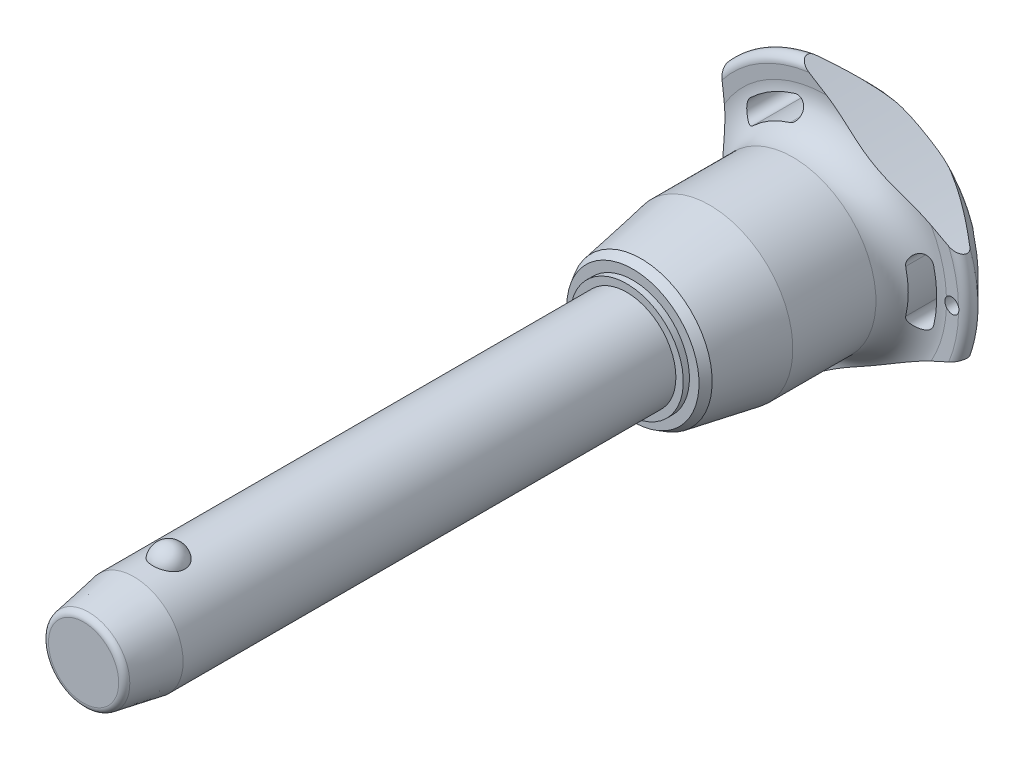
from build123d import *

# Parameters (mm, degrees)
SKETCH1_R           = 10
BOSS_EXTRUDE1_DEPTH = 90
SKETCH2_R           = 8.75
BOSS_EXTRUDE2_DEPTH = 50.7
BOSS_EXTRUDE3_START = 20.5
SKETCH1_2_R         = 10
BOSS_EXTRUDE3_DEPTH = 20.5
CHAMFER1_SIZE       = 10.25
CHAMFER1_SIZE2      = 1.807351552
FILLET1_R           = 1.25
SKETCH6_R           = 176.92625
CUT_EXTRUDE1_DEPTH  = 147.379068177
CIRPATTERN1_COUNT   = 3
SKETCH7_R           = 1.5
CUT_EXTRUDE2_DEPTH  = 147.275035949


with BuildPart() as part:
    # Sketch1 → Boss-Extrude1 (new body)
    with BuildSketch(Plane.XY):
        Circle(SKETCH1_R)
    extrude(amount=-BOSS_EXTRUDE1_DEPTH)

    # Sketch2 → Boss-Extrude2 (add)
    with BuildSketch(Plane(origin=(0, 0, -90), x_dir=(-1, 0, 0), z_dir=(0, 0, -1))):
        with Locations(Location((0, 0, 0), (0, 0, 180))):
            Circle(SKETCH2_R)
    extrude(amount=BOSS_EXTRUDE2_DEPTH)

    # Sketch3 → Revolve1 (revolve)
    with BuildSketch(Plane(origin=(0, 0, 0), x_dir=(0, 0, -1), z_dir=(1, 0, 0))):
        with BuildLine():
            Line((-3.201562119, 12.5), (-3.201562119, 5.9))
            ThreePointArc((-3.201562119, 5.9), (0.098437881, 9.2), (-3.201562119, 12.5))
        make_face()
        with BuildLine():
            Line((-3.201562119, -5.9), (-3.201562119, -12.5))
            ThreePointArc((-3.201562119, -12.5), (0.098437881, -9.2), (-3.201562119, -5.9))
        make_face()
    revolve(axis=Axis((0, -5.9, 3.201562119), (0, 1, 0)))

    # Sketch1_2 → Boss-Extrude3 (add)
    with BuildSketch(Plane.XY.offset(BOSS_EXTRUDE3_START)):
        Circle(SKETCH1_2_R)
    extrude(amount=-BOSS_EXTRUDE3_DEPTH)

    # Chamfer1
    chamfer1_edges = [part.edges().sort_by_distance(p)[0] for p in [
        (-10, 0, 20.5),
    ]]
    chamfer1_side = [part.faces().sort_by_distance(p)[0] for p in [
        (-10, 0, -34.75),
    ]]
    chamfer(chamfer1_edges, length=CHAMFER1_SIZE, length2=CHAMFER1_SIZE2, reference=chamfer1_side[0])

    # Fillet1
    fillet1_edges = [part.edges().sort_by_distance(p)[0] for p in [
        (-8.192648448, 0, 20.5),
        (-8.75, 0, -140.7),
    ]]
    fillet(fillet1_edges, radius=FILLET1_R)

    # Sketch4 → Revolve2 (revolve)
    with BuildSketch(Plane(origin=(0, 0, 0), x_dir=(0, 0, -1), z_dir=(1, 0, 0)), mode=Mode.PRIVATE) as revolve2_sk:
        Polygon((90, 0), (90, 11.504815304), (91.25, 11.504815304), (91.25, 13.461079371), (92.944174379, 14.439211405), (106.9, 16.9), (123.8, 16.9), (123.8, 0), align=None)
    revolve(revolve2_sk.sketch.rotate(Axis((0, 0, -123.8), (0, 0, 1)), 90), axis=Axis((0, 0, -123.8), (0, 0, 1)))

    # Sketch5 → Revolve3 (revolve)
    with BuildSketch(Plane(origin=(0, 0, 0), x_dir=(0, 0, -1), z_dir=(1, 0, 0)), mode=Mode.PRIVATE) as revolve3_sk:
        with BuildLine():
            Line((130.790129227, 24.271609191), (130.652256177, 26.865060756))
            ThreePointArc((130.652256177, 26.865060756), (131.598671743, 28.411427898), (133.38137085, 28.08137085))
            Line((133.38137085, 28.08137085), (139.763226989, 21.69951471))
            ThreePointArc((139.763226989, 21.69951471), (140.7, 19.381044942), (139.683055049, 17.096604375))
            ThreePointArc((139.683055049, 17.096604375), (134.18864484, 9.321268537), (132.25, 0))
            Line((132.25, 0), (123.8, 0))
            Line((123.8, 0), (123.8, 16.9))
            ThreePointArc((123.8, 16.9), (128.879432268, 19.083427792), (130.790129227, 24.271609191))
        make_face()
    revolve(revolve3_sk.sketch.rotate(Axis((0, 0, -132.25), (0, 0, 1)), 90), axis=Axis((0, 0, -132.25), (0, 0, 1)))

    # Sketch6 → Cut-Extrude1 (cut, through all)
    with BuildSketch(Plane.XY):
        with Locations((-197.42625, 0)):
            Circle(SKETCH6_R)
        with BuildLine():
            ThreePointArc((21.802992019, -5.260839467), (22.428706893, 0), (21.802992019, 5.260839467))
            ThreePointArc((21.802992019, 5.260839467), (19.579234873, 6.620060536), (18.220013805, 4.39630339))
            ThreePointArc((18.220013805, 4.39630339), (18.742902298, 0), (18.220013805, -4.39630339))
            ThreePointArc((18.220013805, -4.39630339), (19.579234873, -6.620060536), (21.802992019, -5.260839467))
        make_face()
    cut_extrude1 = extrude(amount=-CUT_EXTRUDE1_DEPTH, mode=Mode.SUBTRACT)

    # CirPattern1: Cut-Extrude1 ×3 about axis
    cirpattern1_axis = Axis((0, 0, 0), (0, 0, 1))
    for i in range(1, CIRPATTERN1_COUNT):
        add(cut_extrude1.rotate(cirpattern1_axis, i * 360 / CIRPATTERN1_COUNT), mode=Mode.SUBTRACT)

    # Sketch7 → Cut-Extrude2 (cut, through all)
    with BuildSketch(Plane.XY):
        with Locations(Location((25.428706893, 0, 0), (0, 0, 17.230769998))):
            Circle(SKETCH7_R)
    extrude(amount=-CUT_EXTRUDE2_DEPTH, mode=Mode.SUBTRACT)


solid = part.part
